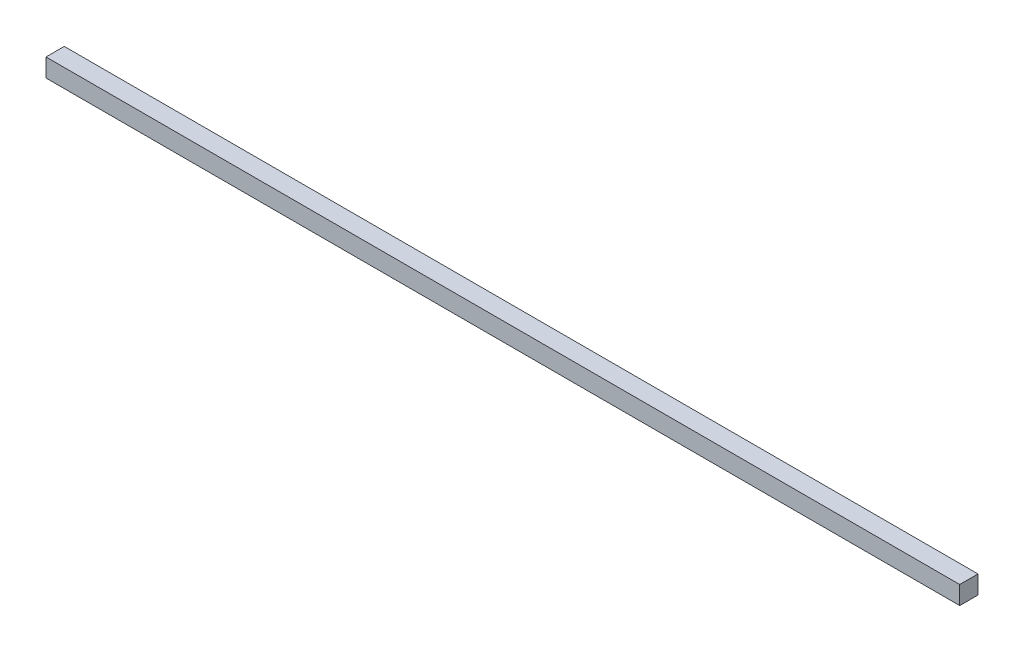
from build123d import *

# Parameters (mm, degrees)
SKETCH_1_W      = 10
SKETCH_1_H      = 10
EXTRUDE_1_DEPTH = 500


with BuildPart() as part:
    # Sketch 1 → Extrude 1 (new body)
    with BuildSketch(Plane.YZ):
        Rectangle(SKETCH_1_W, SKETCH_1_H)
    extrude(amount=EXTRUDE_1_DEPTH)


solid = part.part
